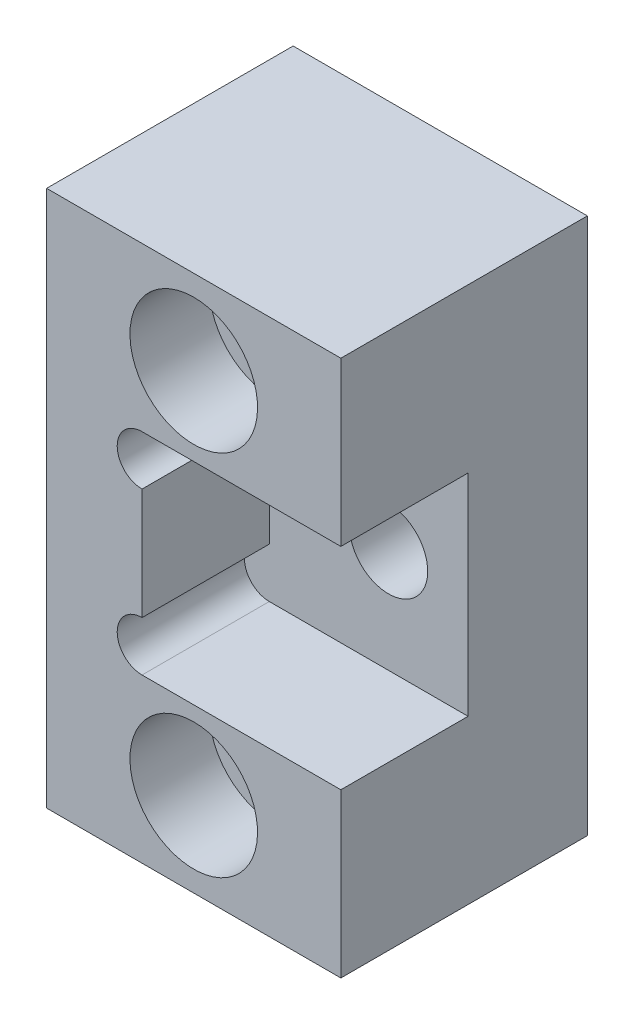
ISO-10303-21;
HEADER;
FILE_DESCRIPTION(('STEP AP214'),'2;1');
FILE_NAME('part.step','',(''),(''),'','','');
FILE_SCHEMA(('AUTOMOTIVE_DESIGN { 1 0 10303 214 1 1 1 1 }'));
ENDSEC;
DATA;
#1=APPLICATION_CONTEXT('core data for automotive mechanical design processes');
#2=APPLICATION_PROTOCOL_DEFINITION('international standard','automotive_design',2000,#1);
#3=PRODUCT_CONTEXT('',#1,'mechanical');
#4=PRODUCT('Part','Part','',(#3));
#5=PRODUCT_RELATED_PRODUCT_CATEGORY('part','',(#4));
#6=PRODUCT_DEFINITION_FORMATION('','',#4);
#7=PRODUCT_DEFINITION_CONTEXT('part definition',#1,'design');
#8=PRODUCT_DEFINITION('design','',#6,#7);
#9=PRODUCT_DEFINITION_SHAPE('','',#8);
#10=(LENGTH_UNIT() NAMED_UNIT(*) SI_UNIT(.MILLI.,.METRE.));
#11=(NAMED_UNIT(*) PLANE_ANGLE_UNIT() SI_UNIT($,.RADIAN.));
#12=(NAMED_UNIT(*) SI_UNIT($,.STERADIAN.) SOLID_ANGLE_UNIT());
#13=UNCERTAINTY_MEASURE_WITH_UNIT(LENGTH_MEASURE(1.E-05),#10,'distance_accuracy_value','');
#14=(GEOMETRIC_REPRESENTATION_CONTEXT(3) GLOBAL_UNCERTAINTY_ASSIGNED_CONTEXT((#13)) GLOBAL_UNIT_ASSIGNED_CONTEXT((#10,
#11,#12)) REPRESENTATION_CONTEXT('',''));
#15=CARTESIAN_POINT('',(0.,0.,0.));
#16=DIRECTION('',(0.,0.,1.));
#17=DIRECTION('',(1.,0.,0.));
#18=AXIS2_PLACEMENT_3D('',#15,#16,#17);
#19=CARTESIAN_POINT('',(18.796,57.785,31.496));
#20=DIRECTION('',(0.,0.,1.));
#21=DIRECTION('',(0.,1.,0.));
#22=AXIS2_PLACEMENT_3D('',#19,#20,#21);
#23=PLANE('',#22);
#24=CARTESIAN_POINT('',(0.,46.99,31.496));
#25=DIRECTION('',(0.,0.,1.));
#26=DIRECTION('',(0.,1.,0.));
#27=AXIS2_PLACEMENT_3D('',#24,#25,#26);
#28=CIRCLE('',#27,8.15);
#29=CARTESIAN_POINT('',(0.,55.14,31.496));
#30=VERTEX_POINT('',#29);
#31=EDGE_CURVE('E176',#30,#30,#28,.F.);
#32=ORIENTED_EDGE('',*,*,#31,.T.);
#33=EDGE_LOOP('',(#32));
#34=FACE_BOUND('',#33,.T.);
#35=DIRECTION('',(0.,1.,0.));
#36=VECTOR('',#35,1.);
#37=CARTESIAN_POINT('',(18.796,-10.795,31.496));
#38=LINE('',#37,#36);
#39=CARTESIAN_POINT('',(18.796,-10.795,31.496));
#40=VERTEX_POINT('',#39);
#41=CARTESIAN_POINT('',(18.796,10.033,31.496));
#42=VERTEX_POINT('',#41);
#43=EDGE_CURVE('E122',#40,#42,#38,.T.);
#44=ORIENTED_EDGE('',*,*,#43,.T.);
#45=DIRECTION('',(1.,0.,0.));
#46=VECTOR('',#45,1.);
#47=CARTESIAN_POINT('',(-6.604,10.033,31.496));
#48=LINE('',#47,#46);
#49=CARTESIAN_POINT('',(-6.604,10.033,31.496));
#50=VERTEX_POINT('',#49);
#51=EDGE_CURVE('E115',#50,#42,#48,.T.);
#52=ORIENTED_EDGE('',*,*,#51,.F.);
#53=CARTESIAN_POINT('',(-6.604,13.208,31.496));
#54=DIRECTION('',(0.,0.,1.));
#55=DIRECTION('',(0.,1.,0.));
#56=AXIS2_PLACEMENT_3D('',#53,#54,#55);
#57=CIRCLE('',#56,3.175);
#58=CARTESIAN_POINT('',(-6.604,16.383,31.496));
#59=VERTEX_POINT('',#58);
#60=EDGE_CURVE('E104',#59,#50,#57,.T.);
#61=ORIENTED_EDGE('',*,*,#60,.F.);
#62=DIRECTION('',(0.,-1.,0.));
#63=VECTOR('',#62,1.);
#64=CARTESIAN_POINT('',(-6.604,30.607,31.496));
#65=LINE('',#64,#63);
#66=CARTESIAN_POINT('',(-6.604,30.607,31.496));
#67=VERTEX_POINT('',#66);
#68=EDGE_CURVE('E111',#67,#59,#65,.T.);
#69=ORIENTED_EDGE('',*,*,#68,.F.);
#70=CARTESIAN_POINT('',(-6.604,33.782,31.496));
#71=DIRECTION('',(0.,0.,1.));
#72=DIRECTION('',(0.,1.,0.));
#73=AXIS2_PLACEMENT_3D('',#70,#71,#72);
#74=CIRCLE('',#73,3.175);
#75=CARTESIAN_POINT('',(-6.604,36.957,31.496));
#76=VERTEX_POINT('',#75);
#77=EDGE_CURVE('E126',#76,#67,#74,.T.);
#78=ORIENTED_EDGE('',*,*,#77,.F.);
#79=DIRECTION('',(-1.,0.,0.));
#80=VECTOR('',#79,1.);
#81=CARTESIAN_POINT('',(18.796,36.957,31.496));
#82=LINE('',#81,#80);
#83=CARTESIAN_POINT('',(18.796,36.957,31.496));
#84=VERTEX_POINT('',#83);
#85=EDGE_CURVE('E123',#84,#76,#82,.T.);
#86=ORIENTED_EDGE('',*,*,#85,.F.);
#87=CARTESIAN_POINT('',(18.796,57.785,31.496));
#88=VERTEX_POINT('',#87);
#89=EDGE_CURVE('E160',#84,#88,#38,.T.);
#90=ORIENTED_EDGE('',*,*,#89,.T.);
#91=DIRECTION('',(-1.,0.,0.));
#92=VECTOR('',#91,1.);
#93=CARTESIAN_POINT('',(18.796,57.785,31.496));
#94=LINE('',#93,#92);
#95=CARTESIAN_POINT('',(-18.796,57.785,31.496));
#96=VERTEX_POINT('',#95);
#97=EDGE_CURVE('E159',#88,#96,#94,.T.);
#98=ORIENTED_EDGE('',*,*,#97,.T.);
#99=DIRECTION('',(0.,-1.,0.));
#100=VECTOR('',#99,1.);
#101=CARTESIAN_POINT('',(-18.796,57.785,31.496));
#102=LINE('',#101,#100);
#103=CARTESIAN_POINT('',(-18.796,-10.795,31.496));
#104=VERTEX_POINT('',#103);
#105=EDGE_CURVE('E42',#96,#104,#102,.T.);
#106=ORIENTED_EDGE('',*,*,#105,.T.);
#107=DIRECTION('',(1.,0.,0.));
#108=VECTOR('',#107,1.);
#109=CARTESIAN_POINT('',(-18.796,-10.795,31.496));
#110=LINE('',#109,#108);
#111=EDGE_CURVE('E68',#104,#40,#110,.T.);
#112=ORIENTED_EDGE('',*,*,#111,.T.);
#113=EDGE_LOOP('',(#44,#52,#61,#69,#78,#86,#90,#98,#106,#112));
#114=FACE_BOUND('',#113,.T.);
#115=CARTESIAN_POINT('',(0.,0.,31.496));
#116=DIRECTION('',(0.,0.,1.));
#117=DIRECTION('',(0.,1.,0.));
#118=AXIS2_PLACEMENT_3D('',#115,#116,#117);
#119=CIRCLE('',#118,8.15);
#120=CARTESIAN_POINT('',(0.,8.15,31.496));
#121=VERTEX_POINT('',#120);
#122=EDGE_CURVE('E20',#121,#121,#119,.F.);
#123=ORIENTED_EDGE('',*,*,#122,.T.);
#124=EDGE_LOOP('',(#123));
#125=FACE_BOUND('',#124,.T.);
#126=ADVANCED_FACE('F16',(#34,#114,#125),#23,.T.);
#127=CARTESIAN_POINT('',(18.796,-10.795,31.496));
#128=DIRECTION('',(-1.,0.,0.));
#129=DIRECTION('',(0.,-1.,0.));
#130=AXIS2_PLACEMENT_3D('',#127,#128,#129);
#131=PLANE('',#130);
#132=DIRECTION('',(0.,0.,-1.));
#133=VECTOR('',#132,1.);
#134=CARTESIAN_POINT('',(18.796,10.033,31.496));
#135=LINE('',#134,#133);
#136=CARTESIAN_POINT('',(18.796,10.033,15.24));
#137=VERTEX_POINT('',#136);
#138=EDGE_CURVE('E155',#42,#137,#135,.T.);
#139=ORIENTED_EDGE('',*,*,#138,.F.);
#140=ORIENTED_EDGE('',*,*,#43,.F.);
#141=DIRECTION('',(0.,0.,-1.));
#142=VECTOR('',#141,1.);
#143=CARTESIAN_POINT('',(18.796,-10.795,31.496));
#144=LINE('',#143,#142);
#145=CARTESIAN_POINT('',(18.796,-10.795,0.));
#146=VERTEX_POINT('',#145);
#147=EDGE_CURVE('E164',#40,#146,#144,.T.);
#148=ORIENTED_EDGE('',*,*,#147,.T.);
#149=DIRECTION('',(0.,1.,0.));
#150=VECTOR('',#149,1.);
#151=CARTESIAN_POINT('',(18.796,-10.795,0.));
#152=LINE('',#151,#150);
#153=CARTESIAN_POINT('',(18.796,57.785,0.));
#154=VERTEX_POINT('',#153);
#155=EDGE_CURVE('E156',#146,#154,#152,.T.);
#156=ORIENTED_EDGE('',*,*,#155,.T.);
#157=DIRECTION('',(0.,0.,-1.));
#158=VECTOR('',#157,1.);
#159=CARTESIAN_POINT('',(18.796,57.785,31.496));
#160=LINE('',#159,#158);
#161=EDGE_CURVE('E10',#88,#154,#160,.T.);
#162=ORIENTED_EDGE('',*,*,#161,.F.);
#163=ORIENTED_EDGE('',*,*,#89,.F.);
#164=DIRECTION('',(0.,0.,-1.));
#165=VECTOR('',#164,1.);
#166=CARTESIAN_POINT('',(18.796,36.957,31.496));
#167=LINE('',#166,#165);
#168=CARTESIAN_POINT('',(18.796,36.957,15.24));
#169=VERTEX_POINT('',#168);
#170=EDGE_CURVE('E152',#84,#169,#167,.T.);
#171=ORIENTED_EDGE('',*,*,#170,.T.);
#172=DIRECTION('',(0.,1.,0.));
#173=VECTOR('',#172,1.);
#174=CARTESIAN_POINT('',(18.796,10.033,15.24));
#175=LINE('',#174,#173);
#176=EDGE_CURVE('E137',#137,#169,#175,.T.);
#177=ORIENTED_EDGE('',*,*,#176,.F.);
#178=EDGE_LOOP('',(#139,#140,#148,#156,#162,#163,#171,#177));
#179=FACE_BOUND('',#178,.T.);
#180=ADVANCED_FACE('F18',(#179),#131,.F.);
#181=CARTESIAN_POINT('',(18.796,57.785,31.496));
#182=DIRECTION('',(0.,-1.,0.));
#183=DIRECTION('',(0.,0.,1.));
#184=AXIS2_PLACEMENT_3D('',#181,#182,#183);
#185=PLANE('',#184);
#186=DIRECTION('',(-1.,0.,0.));
#187=VECTOR('',#186,1.);
#188=CARTESIAN_POINT('',(18.796,57.785,0.));
#189=LINE('',#188,#187);
#190=CARTESIAN_POINT('',(-18.796,57.785,0.));
#191=VERTEX_POINT('',#190);
#192=EDGE_CURVE('E167',#154,#191,#189,.T.);
#193=ORIENTED_EDGE('',*,*,#192,.T.);
#194=DIRECTION('',(0.,0.,-1.));
#195=VECTOR('',#194,1.);
#196=CARTESIAN_POINT('',(-18.796,57.785,31.496));
#197=LINE('',#196,#195);
#198=EDGE_CURVE('E25',#96,#191,#197,.T.);
#199=ORIENTED_EDGE('',*,*,#198,.F.);
#200=ORIENTED_EDGE('',*,*,#97,.F.);
#201=ORIENTED_EDGE('',*,*,#161,.T.);
#202=EDGE_LOOP('',(#193,#199,#200,#201));
#203=FACE_BOUND('',#202,.T.);
#204=ADVANCED_FACE('F247',(#203),#185,.F.);
#205=CARTESIAN_POINT('',(-18.796,57.785,31.496));
#206=DIRECTION('',(1.,0.,0.));
#207=DIRECTION('',(0.,1.,0.));
#208=AXIS2_PLACEMENT_3D('',#205,#206,#207);
#209=PLANE('',#208);
#210=DIRECTION('',(0.,-1.,0.));
#211=VECTOR('',#210,1.);
#212=CARTESIAN_POINT('',(-18.796,57.785,0.));
#213=LINE('',#212,#211);
#214=CARTESIAN_POINT('',(-18.796,-10.795,0.));
#215=VERTEX_POINT('',#214);
#216=EDGE_CURVE('E63',#191,#215,#213,.T.);
#217=ORIENTED_EDGE('',*,*,#216,.T.);
#218=DIRECTION('',(0.,0.,-1.));
#219=VECTOR('',#218,1.);
#220=CARTESIAN_POINT('',(-18.796,-10.795,31.496));
#221=LINE('',#220,#219);
#222=EDGE_CURVE('E172',#104,#215,#221,.T.);
#223=ORIENTED_EDGE('',*,*,#222,.F.);
#224=ORIENTED_EDGE('',*,*,#105,.F.);
#225=ORIENTED_EDGE('',*,*,#198,.T.);
#226=EDGE_LOOP('',(#217,#223,#224,#225));
#227=FACE_BOUND('',#226,.T.);
#228=ADVANCED_FACE('F257',(#227),#209,.F.);
#229=CARTESIAN_POINT('',(-18.796,-10.795,31.496));
#230=DIRECTION('',(0.,1.,0.));
#231=DIRECTION('',(-1.,0.,0.));
#232=AXIS2_PLACEMENT_3D('',#229,#230,#231);
#233=PLANE('',#232);
#234=DIRECTION('',(1.,0.,0.));
#235=VECTOR('',#234,1.);
#236=CARTESIAN_POINT('',(-18.796,-10.795,0.));
#237=LINE('',#236,#235);
#238=EDGE_CURVE('E170',#215,#146,#237,.T.);
#239=ORIENTED_EDGE('',*,*,#238,.T.);
#240=ORIENTED_EDGE('',*,*,#147,.F.);
#241=ORIENTED_EDGE('',*,*,#111,.F.);
#242=ORIENTED_EDGE('',*,*,#222,.T.);
#243=EDGE_LOOP('',(#239,#240,#241,#242));
#244=FACE_BOUND('',#243,.T.);
#245=ADVANCED_FACE('F254',(#244),#233,.F.);
#246=CARTESIAN_POINT('',(18.796,57.785,0.));
#247=DIRECTION('',(0.,0.,1.));
#248=DIRECTION('',(0.,1.,0.));
#249=AXIS2_PLACEMENT_3D('',#246,#247,#248);
#250=PLANE('',#249);
#251=CARTESIAN_POINT('',(8.636,23.495,0.));
#252=DIRECTION('',(0.,0.,1.));
#253=DIRECTION('',(0.,1.,0.));
#254=AXIS2_PLACEMENT_3D('',#251,#252,#253);
#255=CIRCLE('',#254,5.);
#256=CARTESIAN_POINT('',(8.636,28.495,0.));
#257=VERTEX_POINT('',#256);
#258=EDGE_CURVE('E138',#257,#257,#255,.T.);
#259=ORIENTED_EDGE('',*,*,#258,.T.);
#260=EDGE_LOOP('',(#259));
#261=FACE_BOUND('',#260,.T.);
#262=ORIENTED_EDGE('',*,*,#155,.F.);
#263=ORIENTED_EDGE('',*,*,#238,.F.);
#264=ORIENTED_EDGE('',*,*,#216,.F.);
#265=ORIENTED_EDGE('',*,*,#192,.F.);
#266=EDGE_LOOP('',(#262,#263,#264,#265));
#267=FACE_BOUND('',#266,.T.);
#268=CARTESIAN_POINT('',(0.,0.,0.));
#269=DIRECTION('',(0.,0.,1.));
#270=DIRECTION('',(0.,1.,0.));
#271=AXIS2_PLACEMENT_3D('',#268,#269,#270);
#272=CIRCLE('',#271,5.15);
#273=CARTESIAN_POINT('',(0.,5.15,0.));
#274=VERTEX_POINT('',#273);
#275=EDGE_CURVE('E198',#274,#274,#272,.F.);
#276=ORIENTED_EDGE('',*,*,#275,.F.);
#277=EDGE_LOOP('',(#276));
#278=FACE_BOUND('',#277,.T.);
#279=CARTESIAN_POINT('',(0.,46.99,0.));
#280=DIRECTION('',(0.,0.,1.));
#281=DIRECTION('',(0.,1.,0.));
#282=AXIS2_PLACEMENT_3D('',#279,#280,#281);
#283=CIRCLE('',#282,5.15);
#284=CARTESIAN_POINT('',(0.,52.14,0.));
#285=VERTEX_POINT('',#284);
#286=EDGE_CURVE('E183',#285,#285,#283,.F.);
#287=ORIENTED_EDGE('',*,*,#286,.F.);
#288=EDGE_LOOP('',(#287));
#289=FACE_BOUND('',#288,.T.);
#290=ADVANCED_FACE('F251',(#261,#267,#278,#289),#250,.F.);
#291=CARTESIAN_POINT('',(-6.604,10.033,31.496));
#292=DIRECTION('',(0.,1.,0.));
#293=DIRECTION('',(0.,0.,-1.));
#294=AXIS2_PLACEMENT_3D('',#291,#292,#293);
#295=PLANE('',#294);
#296=DIRECTION('',(1.,0.,0.));
#297=VECTOR('',#296,1.);
#298=CARTESIAN_POINT('',(-6.604,10.033,15.24));
#299=LINE('',#298,#297);
#300=CARTESIAN_POINT('',(-6.604,10.033,15.24));
#301=VERTEX_POINT('',#300);
#302=EDGE_CURVE('E118',#301,#137,#299,.T.);
#303=ORIENTED_EDGE('',*,*,#302,.F.);
#304=DIRECTION('',(0.,0.,-1.));
#305=VECTOR('',#304,1.);
#306=CARTESIAN_POINT('',(-6.604,10.033,31.496));
#307=LINE('',#306,#305);
#308=EDGE_CURVE('E107',#50,#301,#307,.T.);
#309=ORIENTED_EDGE('',*,*,#308,.F.);
#310=ORIENTED_EDGE('',*,*,#51,.T.);
#311=ORIENTED_EDGE('',*,*,#138,.T.);
#312=EDGE_LOOP('',(#303,#309,#310,#311));
#313=FACE_BOUND('',#312,.T.);
#314=ADVANCED_FACE('F114',(#313),#295,.T.);
#315=CARTESIAN_POINT('',(18.796,36.957,31.496));
#316=DIRECTION('',(0.,-1.,0.));
#317=DIRECTION('',(0.,0.,1.));
#318=AXIS2_PLACEMENT_3D('',#315,#316,#317);
#319=PLANE('',#318);
#320=DIRECTION('',(-1.,0.,0.));
#321=VECTOR('',#320,1.);
#322=CARTESIAN_POINT('',(18.796,36.957,15.24));
#323=LINE('',#322,#321);
#324=CARTESIAN_POINT('',(-6.604,36.957,15.24));
#325=VERTEX_POINT('',#324);
#326=EDGE_CURVE('E140',#169,#325,#323,.T.);
#327=ORIENTED_EDGE('',*,*,#326,.F.);
#328=ORIENTED_EDGE('',*,*,#170,.F.);
#329=ORIENTED_EDGE('',*,*,#85,.T.);
#330=DIRECTION('',(0.,0.,-1.));
#331=VECTOR('',#330,1.);
#332=CARTESIAN_POINT('',(-6.604,36.957,31.496));
#333=LINE('',#332,#331);
#334=EDGE_CURVE('E149',#76,#325,#333,.T.);
#335=ORIENTED_EDGE('',*,*,#334,.T.);
#336=EDGE_LOOP('',(#327,#328,#329,#335));
#337=FACE_BOUND('',#336,.T.);
#338=ADVANCED_FACE('F220',(#337),#319,.T.);
#339=CARTESIAN_POINT('',(-6.604,33.782,31.496));
#340=DIRECTION('',(0.,0.,-1.));
#341=DIRECTION('',(0.,-1.,0.));
#342=AXIS2_PLACEMENT_3D('',#339,#340,#341);
#343=CYLINDRICAL_SURFACE('',#342,3.175);
#344=CARTESIAN_POINT('',(-6.604,33.782,15.24));
#345=DIRECTION('',(0.,0.,1.));
#346=DIRECTION('',(0.,1.,0.));
#347=AXIS2_PLACEMENT_3D('',#344,#345,#346);
#348=CIRCLE('',#347,3.175);
#349=CARTESIAN_POINT('',(-6.604,30.607,15.24));
#350=VERTEX_POINT('',#349);
#351=EDGE_CURVE('E142',#325,#350,#348,.T.);
#352=ORIENTED_EDGE('',*,*,#351,.F.);
#353=ORIENTED_EDGE('',*,*,#334,.F.);
#354=ORIENTED_EDGE('',*,*,#77,.T.);
#355=DIRECTION('',(0.,0.,-1.));
#356=VECTOR('',#355,1.);
#357=CARTESIAN_POINT('',(-6.604,30.607,31.496));
#358=LINE('',#357,#356);
#359=EDGE_CURVE('E146',#67,#350,#358,.T.);
#360=ORIENTED_EDGE('',*,*,#359,.T.);
#361=EDGE_LOOP('',(#352,#353,#354,#360));
#362=FACE_BOUND('',#361,.T.);
#363=ADVANCED_FACE('F227',(#362),#343,.F.);
#364=CARTESIAN_POINT('',(-6.604,30.607,31.496));
#365=DIRECTION('',(1.,0.,0.));
#366=DIRECTION('',(0.,0.,-1.));
#367=AXIS2_PLACEMENT_3D('',#364,#365,#366);
#368=PLANE('',#367);
#369=DIRECTION('',(0.,-1.,0.));
#370=VECTOR('',#369,1.);
#371=CARTESIAN_POINT('',(-6.604,30.607,15.24));
#372=LINE('',#371,#370);
#373=CARTESIAN_POINT('',(-6.604,16.383,15.24));
#374=VERTEX_POINT('',#373);
#375=EDGE_CURVE('E128',#350,#374,#372,.T.);
#376=ORIENTED_EDGE('',*,*,#375,.F.);
#377=ORIENTED_EDGE('',*,*,#359,.F.);
#378=ORIENTED_EDGE('',*,*,#68,.T.);
#379=DIRECTION('',(0.,0.,-1.));
#380=VECTOR('',#379,1.);
#381=CARTESIAN_POINT('',(-6.604,16.383,31.496));
#382=LINE('',#381,#380);
#383=EDGE_CURVE('E33',#59,#374,#382,.T.);
#384=ORIENTED_EDGE('',*,*,#383,.T.);
#385=EDGE_LOOP('',(#376,#377,#378,#384));
#386=FACE_BOUND('',#385,.T.);
#387=ADVANCED_FACE('F230',(#386),#368,.T.);
#388=CARTESIAN_POINT('',(-6.604,13.208,31.496));
#389=DIRECTION('',(0.,0.,-1.));
#390=DIRECTION('',(0.,-1.,0.));
#391=AXIS2_PLACEMENT_3D('',#388,#389,#390);
#392=CYLINDRICAL_SURFACE('',#391,3.175);
#393=CARTESIAN_POINT('',(-6.604,13.208,15.24));
#394=DIRECTION('',(0.,0.,1.));
#395=DIRECTION('',(0.,1.,0.));
#396=AXIS2_PLACEMENT_3D('',#393,#394,#395);
#397=CIRCLE('',#396,3.175);
#398=EDGE_CURVE('E124',#374,#301,#397,.T.);
#399=ORIENTED_EDGE('',*,*,#398,.F.);
#400=ORIENTED_EDGE('',*,*,#383,.F.);
#401=ORIENTED_EDGE('',*,*,#60,.T.);
#402=ORIENTED_EDGE('',*,*,#308,.T.);
#403=EDGE_LOOP('',(#399,#400,#401,#402));
#404=FACE_BOUND('',#403,.T.);
#405=ADVANCED_FACE('F106',(#404),#392,.F.);
#406=CARTESIAN_POINT('',(-6.604,33.782,15.24));
#407=DIRECTION('',(0.,0.,1.));
#408=DIRECTION('',(0.,1.,0.));
#409=AXIS2_PLACEMENT_3D('',#406,#407,#408);
#410=PLANE('',#409);
#411=CARTESIAN_POINT('',(8.636,23.495,15.24));
#412=DIRECTION('',(0.,0.,1.));
#413=DIRECTION('',(0.,1.,0.));
#414=AXIS2_PLACEMENT_3D('',#411,#412,#413);
#415=CIRCLE('',#414,5.);
#416=CARTESIAN_POINT('',(8.636,28.495,15.24));
#417=VERTEX_POINT('',#416);
#418=EDGE_CURVE('E131',#417,#417,#415,.T.);
#419=ORIENTED_EDGE('',*,*,#418,.F.);
#420=EDGE_LOOP('',(#419));
#421=FACE_BOUND('',#420,.T.);
#422=ORIENTED_EDGE('',*,*,#302,.T.);
#423=ORIENTED_EDGE('',*,*,#176,.T.);
#424=ORIENTED_EDGE('',*,*,#326,.T.);
#425=ORIENTED_EDGE('',*,*,#351,.T.);
#426=ORIENTED_EDGE('',*,*,#375,.T.);
#427=ORIENTED_EDGE('',*,*,#398,.T.);
#428=EDGE_LOOP('',(#422,#423,#424,#425,#426,#427));
#429=FACE_BOUND('',#428,.T.);
#430=ADVANCED_FACE('F208',(#421,#429),#410,.T.);
#431=CARTESIAN_POINT('',(0.,0.,21.336));
#432=DIRECTION('',(0.,0.,-1.));
#433=DIRECTION('',(0.,-1.,0.));
#434=AXIS2_PLACEMENT_3D('',#431,#432,#433);
#435=PLANE('',#434);
#436=CARTESIAN_POINT('',(0.,0.,21.336));
#437=DIRECTION('',(0.,0.,1.));
#438=DIRECTION('',(0.,1.,0.));
#439=AXIS2_PLACEMENT_3D('',#436,#437,#438);
#440=CIRCLE('',#439,5.15);
#441=CARTESIAN_POINT('',(0.,5.15,21.336));
#442=VERTEX_POINT('',#441);
#443=EDGE_CURVE('E195',#442,#442,#440,.T.);
#444=ORIENTED_EDGE('',*,*,#443,.F.);
#445=EDGE_LOOP('',(#444));
#446=FACE_BOUND('',#445,.T.);
#447=CARTESIAN_POINT('',(0.,0.,21.336));
#448=DIRECTION('',(0.,0.,1.));
#449=DIRECTION('',(0.,1.,0.));
#450=AXIS2_PLACEMENT_3D('',#447,#448,#449);
#451=CIRCLE('',#450,8.15);
#452=CARTESIAN_POINT('',(0.,8.15,21.336));
#453=VERTEX_POINT('',#452);
#454=EDGE_CURVE('E190',#453,#453,#451,.T.);
#455=ORIENTED_EDGE('',*,*,#454,.T.);
#456=EDGE_LOOP('',(#455));
#457=FACE_BOUND('',#456,.T.);
#458=ADVANCED_FACE('F211',(#446,#457),#435,.F.);
#459=CARTESIAN_POINT('',(0.,46.99,21.336));
#460=DIRECTION('',(0.,0.,-1.));
#461=DIRECTION('',(0.,-1.,0.));
#462=AXIS2_PLACEMENT_3D('',#459,#460,#461);
#463=PLANE('',#462);
#464=CARTESIAN_POINT('',(0.,46.99,21.336));
#465=DIRECTION('',(0.,0.,1.));
#466=DIRECTION('',(0.,1.,0.));
#467=AXIS2_PLACEMENT_3D('',#464,#465,#466);
#468=CIRCLE('',#467,5.15);
#469=CARTESIAN_POINT('',(0.,52.14,21.336));
#470=VERTEX_POINT('',#469);
#471=EDGE_CURVE('E178',#470,#470,#468,.T.);
#472=ORIENTED_EDGE('',*,*,#471,.F.);
#473=EDGE_LOOP('',(#472));
#474=FACE_BOUND('',#473,.T.);
#475=CARTESIAN_POINT('',(0.,46.99,21.336));
#476=DIRECTION('',(0.,0.,1.));
#477=DIRECTION('',(0.,1.,0.));
#478=AXIS2_PLACEMENT_3D('',#475,#476,#477);
#479=CIRCLE('',#478,8.15);
#480=CARTESIAN_POINT('',(0.,55.14,21.336));
#481=VERTEX_POINT('',#480);
#482=EDGE_CURVE('E179',#481,#481,#479,.T.);
#483=ORIENTED_EDGE('',*,*,#482,.T.);
#484=EDGE_LOOP('',(#483));
#485=FACE_BOUND('',#484,.T.);
#486=ADVANCED_FACE('F282',(#474,#485),#463,.F.);
#487=CARTESIAN_POINT('',(8.636,23.495,0.));
#488=DIRECTION('',(0.,0.,1.));
#489=DIRECTION('',(0.,1.,0.));
#490=AXIS2_PLACEMENT_3D('',#487,#488,#489);
#491=CYLINDRICAL_SURFACE('',#490,5.);
#492=ORIENTED_EDGE('',*,*,#258,.F.);
#493=EDGE_LOOP('',(#492));
#494=FACE_BOUND('',#493,.T.);
#495=ORIENTED_EDGE('',*,*,#418,.T.);
#496=EDGE_LOOP('',(#495));
#497=FACE_BOUND('',#496,.T.);
#498=ADVANCED_FACE('F206',(#494,#497),#491,.F.);
#499=CARTESIAN_POINT('',(0.,0.,-18.8970385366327));
#500=DIRECTION('',(0.,0.,1.));
#501=DIRECTION('',(0.,1.,0.));
#502=AXIS2_PLACEMENT_3D('',#499,#500,#501);
#503=CYLINDRICAL_SURFACE('',#502,5.15);
#504=ORIENTED_EDGE('',*,*,#275,.T.);
#505=EDGE_LOOP('',(#504));
#506=FACE_BOUND('',#505,.T.);
#507=ORIENTED_EDGE('',*,*,#443,.T.);
#508=EDGE_LOOP('',(#507));
#509=FACE_BOUND('',#508,.T.);
#510=ADVANCED_FACE('F278',(#506,#509),#503,.F.);
#511=CARTESIAN_POINT('',(0.,46.99,-18.8970385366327));
#512=DIRECTION('',(0.,0.,1.));
#513=DIRECTION('',(0.,1.,0.));
#514=AXIS2_PLACEMENT_3D('',#511,#512,#513);
#515=CYLINDRICAL_SURFACE('',#514,5.15);
#516=ORIENTED_EDGE('',*,*,#286,.T.);
#517=EDGE_LOOP('',(#516));
#518=FACE_BOUND('',#517,.T.);
#519=ORIENTED_EDGE('',*,*,#471,.T.);
#520=EDGE_LOOP('',(#519));
#521=FACE_BOUND('',#520,.T.);
#522=ADVANCED_FACE('F274',(#518,#521),#515,.F.);
#523=CARTESIAN_POINT('',(0.,46.99,41.336));
#524=DIRECTION('',(0.,0.,-1.));
#525=DIRECTION('',(0.,-1.,0.));
#526=AXIS2_PLACEMENT_3D('',#523,#524,#525);
#527=CYLINDRICAL_SURFACE('',#526,8.15);
#528=ORIENTED_EDGE('',*,*,#31,.F.);
#529=EDGE_LOOP('',(#528));
#530=FACE_BOUND('',#529,.T.);
#531=ORIENTED_EDGE('',*,*,#482,.F.);
#532=EDGE_LOOP('',(#531));
#533=FACE_BOUND('',#532,.T.);
#534=ADVANCED_FACE('F277',(#530,#533),#527,.F.);
#535=CARTESIAN_POINT('',(0.,0.,41.336));
#536=DIRECTION('',(0.,0.,-1.));
#537=DIRECTION('',(0.,-1.,0.));
#538=AXIS2_PLACEMENT_3D('',#535,#536,#537);
#539=CYLINDRICAL_SURFACE('',#538,8.15);
#540=ORIENTED_EDGE('',*,*,#122,.F.);
#541=EDGE_LOOP('',(#540));
#542=FACE_BOUND('',#541,.T.);
#543=ORIENTED_EDGE('',*,*,#454,.F.);
#544=EDGE_LOOP('',(#543));
#545=FACE_BOUND('',#544,.T.);
#546=ADVANCED_FACE('F300',(#542,#545),#539,.F.);
#547=CLOSED_SHELL('',(#126,#180,#204,#228,#245,#290,#314,#338,#363,#387,#405,#430,#458,#486,
#498,#510,#522,#534,#546));
#548=MANIFOLD_SOLID_BREP('B1',#547);
#549=ADVANCED_BREP_SHAPE_REPRESENTATION('',(#18,#548),#14);
#550=SHAPE_DEFINITION_REPRESENTATION(#9,#549);
ENDSEC;
END-ISO-10303-21;
